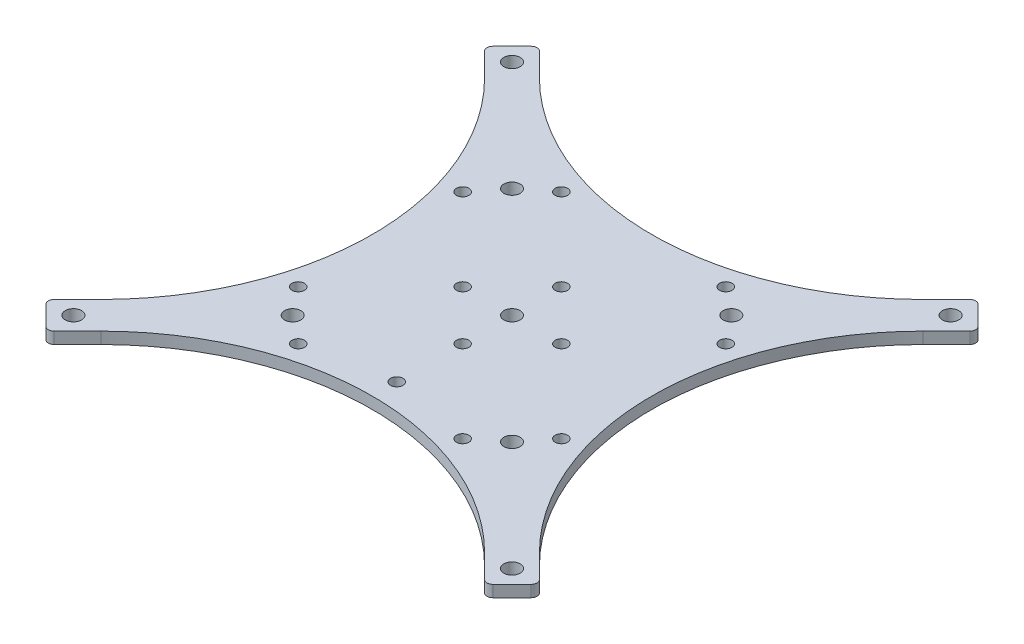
from build123d import *

# Parameters (mm, degrees)
SKETCH_1_R      = 2.1
SKETCH_1_R_2    = 1.6
EXTRUDE_1_DEPTH = 3
FILLET_1_R      = 1.5


with BuildPart() as part:
    # Sketch 1 → Extrude 1 (new body)
    with BuildSketch(Plane(origin=(0, 0, 0), x_dir=(1, 0, 0), z_dir=(0, 1, 0))):
        with BuildLine():
            Line((-49.497474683, -56.568542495), (-56.568542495, -63.639610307))
            Line((-56.568542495, -63.639610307), (-63.639610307, -56.568542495))
            Line((-63.639610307, -56.568542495), (-56.568551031, -49.497483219))
            ThreePointArc((-56.568551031, -49.497483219), (-36.066017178, -6.036e-06), (-56.568542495, 49.497474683))
            Line((-56.568542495, 49.497474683), (-63.639610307, 56.568542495))
            Line((-63.639610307, 56.568542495), (-56.568542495, 63.639610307))
            Line((-56.568542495, 63.639610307), (-49.497483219, 56.568551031))
            ThreePointArc((-49.497483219, 56.568551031), (-6.036e-06, 36.066017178), (49.497474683, 56.568542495))
            Line((49.497474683, 56.568542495), (56.568542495, 63.639610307))
            Line((56.568542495, 63.639610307), (63.639610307, 56.568542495))
            Line((63.639610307, 56.568542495), (56.568551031, 49.497483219))
            ThreePointArc((56.568551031, 49.497483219), (36.066017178, 6.036e-06), (56.568542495, -49.497474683))
            Line((56.568542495, -49.497474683), (63.639610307, -56.568542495))
            Line((63.639610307, -56.568542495), (56.568542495, -63.639610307))
            Line((56.568542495, -63.639610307), (49.497483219, -56.568551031))
            ThreePointArc((49.497483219, -56.568551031), (6.036e-06, -36.066017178), (-49.497474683, -56.568542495))
        make_face()
        with Locations(Location((0, 0, 0), (0, 0, 270))):
            Circle(SKETCH_1_R, mode=Mode.SUBTRACT)
        with Locations(Location((28.284271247, -28.284271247, 0), (0, 0, 270))):
            Circle(SKETCH_1_R, mode=Mode.SUBTRACT)
        with Locations(Location((56.568542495, -56.568542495, 0), (0, 0, 270))):
            Circle(SKETCH_1_R, mode=Mode.SUBTRACT)
        with Locations(Location((-28.284271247, -28.284271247, 0), (0, 0, 270))):
            Circle(SKETCH_1_R, mode=Mode.SUBTRACT)
        with Locations(Location((-56.568542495, -56.568542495, 0), (0, 0, 270))):
            Circle(SKETCH_1_R, mode=Mode.SUBTRACT)
        with Locations(Location((-28.284271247, 28.284271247, 0), (0, 0, 270))):
            Circle(SKETCH_1_R, mode=Mode.SUBTRACT)
        with Locations(Location((-56.568542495, 56.568542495, 0), (0, 0, 270))):
            Circle(SKETCH_1_R, mode=Mode.SUBTRACT)
        with Locations(Location((28.284271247, 28.284271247, 0), (0, 0, 270))):
            Circle(SKETCH_1_R, mode=Mode.SUBTRACT)
        with Locations(Location((56.568542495, 56.568542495, 0), (0, 0, 270))):
            Circle(SKETCH_1_R, mode=Mode.SUBTRACT)
        with Locations(Location((-21.213203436, -33.941125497, 0), (0, 0, 270))):
            Circle(SKETCH_1_R_2, mode=Mode.SUBTRACT)
        with Locations(Location((21.213203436, -33.941125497, 0), (0, 0, 270))):
            Circle(SKETCH_1_R_2, mode=Mode.SUBTRACT)
        with Locations(Location((0, -12.727922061, 0), (0, 0, 270))):
            Circle(SKETCH_1_R_2, mode=Mode.SUBTRACT)
        with Locations(Location((0, -29.727922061, 0), (0, 0, 270))):
            Circle(SKETCH_1_R_2, mode=Mode.SUBTRACT)
        with Locations(Location((-33.941125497, 21.213203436, 0), (0, 0, 270))):
            Circle(SKETCH_1_R_2, mode=Mode.SUBTRACT)
        with Locations(Location((-12.727922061, 0, 0), (0, 0, 270))):
            Circle(SKETCH_1_R_2, mode=Mode.SUBTRACT)
        with Locations(Location((-33.941125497, -21.213203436, 0), (0, 0, 270))):
            Circle(SKETCH_1_R_2, mode=Mode.SUBTRACT)
        with Locations(Location((21.213203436, 33.941125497, 0), (0, 0, 270))):
            Circle(SKETCH_1_R_2, mode=Mode.SUBTRACT)
        with Locations(Location((0, 12.727922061, 0), (0, 0, 270))):
            Circle(SKETCH_1_R_2, mode=Mode.SUBTRACT)
        with Locations(Location((-21.213203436, 33.941125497, 0), (0, 0, 270))):
            Circle(SKETCH_1_R_2, mode=Mode.SUBTRACT)
        with Locations(Location((33.941125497, -21.213203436, 0), (0, 0, 270))):
            Circle(SKETCH_1_R_2, mode=Mode.SUBTRACT)
        with Locations(Location((12.727922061, 0, 0), (0, 0, 270))):
            Circle(SKETCH_1_R_2, mode=Mode.SUBTRACT)
        with Locations(Location((33.941125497, 21.213203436, 0), (0, 0, 270))):
            Circle(SKETCH_1_R_2, mode=Mode.SUBTRACT)
    extrude(amount=EXTRUDE_1_DEPTH)

    # Fillet 1
    fillet_1_edges = [part.edges().sort_by_distance(p)[0] for p in [
        (-63.639610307, 1.5, -56.568542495),
        (-56.568542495, 1.5, -63.639610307),
        (56.568542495, 1.5, -63.639610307),
        (63.639610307, 1.5, -56.568542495),
        (63.639610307, 1.5, 56.568542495),
        (56.568542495, 1.5, 63.639610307),
        (-56.568542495, 1.5, 63.639610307),
        (-63.639610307, 1.5, 56.568542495),
    ]]
    fillet(fillet_1_edges, radius=FILLET_1_R)


solid = part.part
